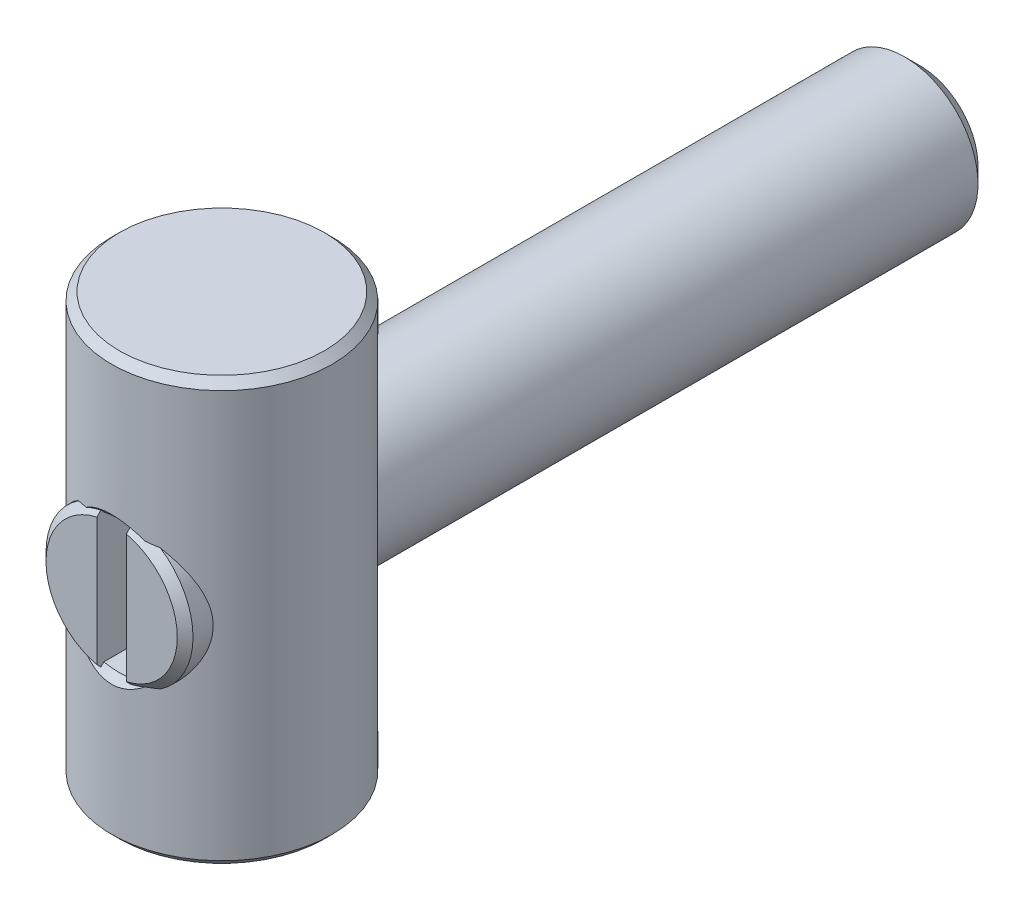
ISO-10303-21;
HEADER;
FILE_DESCRIPTION(('STEP AP214'),'2;1');
FILE_NAME('part.step','',(''),(''),'','','');
FILE_SCHEMA(('AUTOMOTIVE_DESIGN { 1 0 10303 214 1 1 1 1 }'));
ENDSEC;
DATA;
#1=APPLICATION_CONTEXT('core data for automotive mechanical design processes');
#2=APPLICATION_PROTOCOL_DEFINITION('international standard','automotive_design',2000,#1);
#3=PRODUCT_CONTEXT('',#1,'mechanical');
#4=PRODUCT('Part','Part','',(#3));
#5=PRODUCT_RELATED_PRODUCT_CATEGORY('part','',(#4));
#6=PRODUCT_DEFINITION_FORMATION('','',#4);
#7=PRODUCT_DEFINITION_CONTEXT('part definition',#1,'design');
#8=PRODUCT_DEFINITION('design','',#6,#7);
#9=PRODUCT_DEFINITION_SHAPE('','',#8);
#10=(LENGTH_UNIT() NAMED_UNIT(*) SI_UNIT(.MILLI.,.METRE.));
#11=(NAMED_UNIT(*) PLANE_ANGLE_UNIT() SI_UNIT($,.RADIAN.));
#12=(NAMED_UNIT(*) SI_UNIT($,.STERADIAN.) SOLID_ANGLE_UNIT());
#13=UNCERTAINTY_MEASURE_WITH_UNIT(LENGTH_MEASURE(1.E-05),#10,'distance_accuracy_value','');
#14=(GEOMETRIC_REPRESENTATION_CONTEXT(3) GLOBAL_UNCERTAINTY_ASSIGNED_CONTEXT((#13)) GLOBAL_UNIT_ASSIGNED_CONTEXT((#10,
#11,#12)) REPRESENTATION_CONTEXT('',''));
#15=CARTESIAN_POINT('',(0.,0.,0.));
#16=DIRECTION('',(0.,0.,1.));
#17=DIRECTION('',(1.,0.,0.));
#18=AXIS2_PLACEMENT_3D('',#15,#16,#17);
#19=CARTESIAN_POINT('',(0.,0.,-4.));
#20=DIRECTION('',(0.,0.,-1.));
#21=DIRECTION('',(-1.,0.,0.));
#22=AXIS2_PLACEMENT_3D('',#19,#20,#21);
#23=CYLINDRICAL_SURFACE('',#22,2.);
#24=CARTESIAN_POINT('',(1.11399719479,1.6610268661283,2.7855));
#25=CARTESIAN_POINT('',(1.16352046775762,1.62780404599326,2.76569630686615));
#26=CARTESIAN_POINT('',(1.21129322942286,1.59256213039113,2.74505589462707));
#27=CARTESIAN_POINT('',(1.30320814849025,1.51827100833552,2.70263011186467));
#28=CARTESIAN_POINT('',(1.34735150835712,1.47922307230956,2.68084512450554));
#29=CARTESIAN_POINT('',(1.47484746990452,1.35604681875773,2.61420147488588));
#30=CARTESIAN_POINT('',(1.55249324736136,1.26640812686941,2.56837763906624));
#31=CARTESIAN_POINT('',(1.69127884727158,1.07409237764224,2.47919034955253));
#32=CARTESIAN_POINT('',(1.75241552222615,0.971412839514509,2.43582736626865));
#33=CARTESIAN_POINT('',(1.85615019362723,0.754349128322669,2.35773638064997));
#34=CARTESIAN_POINT('',(1.89882852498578,0.640018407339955,2.32297124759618));
#35=CARTESIAN_POINT('',(1.95314493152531,0.438747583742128,2.27729599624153));
#36=CARTESIAN_POINT('',(1.97029467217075,0.354216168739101,2.26233654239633));
#37=CARTESIAN_POINT('',(1.99352675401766,0.182551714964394,2.24189698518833));
#38=CARTESIAN_POINT('',(1.99962325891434,0.0954221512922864,2.23640475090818));
#39=CARTESIAN_POINT('',(2.00034328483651,-0.079061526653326,2.23576112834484));
#40=CARTESIAN_POINT('',(1.99494860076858,-0.166415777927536,2.24062614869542));
#41=CARTESIAN_POINT('',(1.97303463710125,-0.338667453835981,2.25994148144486));
#42=CARTESIAN_POINT('',(1.95650152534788,-0.423561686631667,2.27440371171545));
#43=CARTESIAN_POINT('',(1.90813577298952,-0.608419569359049,2.31521704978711));
#44=CARTESIAN_POINT('',(1.87361856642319,-0.707228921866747,2.34356486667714));
#45=CARTESIAN_POINT('',(1.79082971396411,-0.8964602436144,2.40741595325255));
#46=CARTESIAN_POINT('',(1.7425316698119,-0.986865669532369,2.44293291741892));
#47=CARTESIAN_POINT('',(1.63252243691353,-1.15999565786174,2.51781416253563));
#48=CARTESIAN_POINT('',(1.57057489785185,-1.2425426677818,2.55723849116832));
#49=CARTESIAN_POINT('',(1.43480463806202,-1.39709631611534,2.63580434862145));
#50=CARTESIAN_POINT('',(1.36100810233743,-1.46912554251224,2.67494630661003));
#51=CARTESIAN_POINT('',(1.25497641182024,-1.55764120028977,2.72505273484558));
#52=CARTESIAN_POINT('',(1.22762940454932,-1.57928737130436,2.73749131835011));
#53=CARTESIAN_POINT('',(1.17172197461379,-1.62119899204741,2.76188255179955));
#54=CARTESIAN_POINT('',(1.14316238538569,-1.64146536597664,2.77383552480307));
#55=CARTESIAN_POINT('',(1.11399719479,-1.6610268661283,2.7855));
#56=B_SPLINE_CURVE_WITH_KNOTS('',3,(#24,#25,#26,#27,#28,#29,#30,#31,#32,#33,#34,#35,#36,#37,#38,
#39,#40,#41,#42,#43,#44,#45,#46,#47,#48,#49,#50,#51,#52,#53,#54,#55),.UNSPECIFIED.,.F.,.F.,(4,2,
2,2,2,2,2,2,2,2,2,2,2,2,2,4),(0.,0.188362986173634,0.376663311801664,0.756187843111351,
1.135784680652,1.51371238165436,1.77524600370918,2.03644425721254,2.29805662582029,
2.55999447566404,2.88356492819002,3.20775941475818,3.5380838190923,3.86768804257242,
3.97873730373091,4.08971143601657),.UNSPECIFIED.);
#57=CARTESIAN_POINT('',(1.11399719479,1.6610268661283,2.7855));
#58=VERTEX_POINT('',#57);
#59=CARTESIAN_POINT('',(1.11399719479,-1.6610268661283,2.7855));
#60=VERTEX_POINT('',#59);
#61=EDGE_CURVE('E228',#58,#60,#56,.T.);
#62=ORIENTED_EDGE('',*,*,#61,.F.);
#63=CARTESIAN_POINT('',(0.,0.,2.7855));
#64=DIRECTION('',(0.,0.,-1.));
#65=DIRECTION('',(-1.,0.,0.));
#66=AXIS2_PLACEMENT_3D('',#63,#64,#65);
#67=CIRCLE('',#66,2.);
#68=EDGE_CURVE('E125',#58,#60,#67,.T.);
#69=ORIENTED_EDGE('',*,*,#68,.T.);
#70=EDGE_LOOP('',(#62,#69));
#71=FACE_BOUND('',#70,.T.);
#72=ADVANCED_FACE('F14',(#71),#23,.T.);
#73=CARTESIAN_POINT('',(0.,0.,3.));
#74=DIRECTION('',(0.,0.,-1.));
#75=DIRECTION('',(-1.,0.,0.));
#76=AXIS2_PLACEMENT_3D('',#73,#74,#75);
#77=PLANE('',#76);
#78=DIRECTION('',(0.,-1.,0.));
#79=VECTOR('',#78,1.);
#80=CARTESIAN_POINT('',(-0.4,0.,3.));
#81=LINE('',#80,#79);
#82=CARTESIAN_POINT('',(-0.4,1.74011788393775,3.));
#83=VERTEX_POINT('',#82);
#84=CARTESIAN_POINT('',(-0.4,-1.74011788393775,3.));
#85=VERTEX_POINT('',#84);
#86=EDGE_CURVE('E110',#83,#85,#81,.T.);
#87=ORIENTED_EDGE('',*,*,#86,.F.);
#88=CARTESIAN_POINT('',(0.,0.,3.));
#89=DIRECTION('',(0.,0.,-1.));
#90=DIRECTION('',(-1.,0.,0.));
#91=AXIS2_PLACEMENT_3D('',#88,#89,#90);
#92=CIRCLE('',#91,1.7855);
#93=EDGE_CURVE('E121',#85,#83,#92,.T.);
#94=ORIENTED_EDGE('',*,*,#93,.F.);
#95=EDGE_LOOP('',(#87,#94));
#96=FACE_BOUND('',#95,.T.);
#97=ADVANCED_FACE('F120',(#96),#77,.F.);
#98=CARTESIAN_POINT('',(0.,0.,3.));
#99=DIRECTION('',(0.,0.,-1.));
#100=DIRECTION('',(-1.,0.,0.));
#101=AXIS2_PLACEMENT_3D('',#98,#99,#100);
#102=CONICAL_SURFACE('',#101,1.7855,0.785398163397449);
#103=CARTESIAN_POINT('',(-1.16667612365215,1.65104074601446,2.76385));
#104=CARTESIAN_POINT('',(-1.09329916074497,1.66504476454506,2.79481750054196));
#105=CARTESIAN_POINT('',(-1.01868995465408,1.67914160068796,2.82287437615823));
#106=CARTESIAN_POINT('',(-0.86782079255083,1.70596914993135,2.87283254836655));
#107=CARTESIAN_POINT('',(-0.791576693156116,1.7187090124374,2.89477692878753));
#108=CARTESIAN_POINT('',(-0.637125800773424,1.74152361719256,2.93264181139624));
#109=CARTESIAN_POINT('',(-0.558917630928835,1.75159642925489,2.94855795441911));
#110=CARTESIAN_POINT('',(-0.440293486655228,1.76402293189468,2.96778774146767));
#111=CARTESIAN_POINT('',(-0.400383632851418,1.76772662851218,2.97343575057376));
#112=CARTESIAN_POINT('',(-0.320283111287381,1.77413676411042,2.98312696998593));
#113=CARTESIAN_POINT('',(-0.280092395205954,1.77684302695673,2.98716989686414));
#114=CARTESIAN_POINT('',(-0.2398,1.77901031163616,2.99040063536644));
#115=B_SPLINE_CURVE_WITH_KNOTS('',3,(#103,#104,#105,#106,#107,#108,#109,#110,#111,#112,#113,
#114),.UNSPECIFIED.,.F.,.F.,(4,2,2,2,2,4),(0.,0.242566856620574,0.483378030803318,
0.724363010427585,0.845755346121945,0.967169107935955),.UNSPECIFIED.);
#116=CARTESIAN_POINT('',(-1.11399719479,1.6610268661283,2.7855));
#117=VERTEX_POINT('',#116);
#118=CARTESIAN_POINT('',(-0.794982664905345,1.71770344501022,2.89275));
#119=VERTEX_POINT('',#118);
#120=EDGE_CURVE('E9',#117,#119,#115,.T.);
#121=ORIENTED_EDGE('',*,*,#120,.F.);
#122=CARTESIAN_POINT('',(-1.11399719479,-1.6610268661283,2.7855));
#123=VERTEX_POINT('',#122);
#124=EDGE_CURVE('E130',#123,#117,#67,.T.);
#125=ORIENTED_EDGE('',*,*,#124,.F.);
#126=CARTESIAN_POINT('',(-0.2398,-1.77901031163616,2.99040063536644));
#127=CARTESIAN_POINT('',(-0.280092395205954,-1.77684302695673,2.98716989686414));
#128=CARTESIAN_POINT('',(-0.320283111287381,-1.77413676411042,2.98312696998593));
#129=CARTESIAN_POINT('',(-0.400383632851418,-1.76772662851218,2.97343575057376));
#130=CARTESIAN_POINT('',(-0.440293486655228,-1.76402293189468,2.96778774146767));
#131=CARTESIAN_POINT('',(-0.558917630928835,-1.75159642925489,2.94855795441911));
#132=CARTESIAN_POINT('',(-0.637125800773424,-1.74152361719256,2.93264181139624));
#133=CARTESIAN_POINT('',(-0.791576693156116,-1.7187090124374,2.89477692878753));
#134=CARTESIAN_POINT('',(-0.86782079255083,-1.70596914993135,2.87283254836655));
#135=CARTESIAN_POINT('',(-1.01868995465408,-1.67914160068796,2.82287437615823));
#136=CARTESIAN_POINT('',(-1.09329916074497,-1.66504476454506,2.79481750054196));
#137=CARTESIAN_POINT('',(-1.16667612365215,-1.65104074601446,2.76385));
#138=B_SPLINE_CURVE_WITH_KNOTS('',3,(#126,#127,#128,#129,#130,#131,#132,#133,#134,#135,#136,
#137),.UNSPECIFIED.,.F.,.F.,(4,2,2,2,2,4),(0.,0.12141376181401,0.24280609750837,
0.483791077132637,0.724602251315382,0.967169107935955),.UNSPECIFIED.);
#139=CARTESIAN_POINT('',(-0.794982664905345,-1.71770344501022,2.89275));
#140=VERTEX_POINT('',#139);
#141=EDGE_CURVE('E40',#140,#123,#138,.T.);
#142=ORIENTED_EDGE('',*,*,#141,.F.);
#143=CARTESIAN_POINT('',(0.,0.,2.89275));
#144=DIRECTION('',(0.,0.,1.));
#145=DIRECTION('',(1.,0.,0.));
#146=AXIS2_PLACEMENT_3D('',#143,#144,#145);
#147=CIRCLE('',#146,1.89275);
#148=CARTESIAN_POINT('',(-0.4,-1.85000069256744,2.89275));
#149=VERTEX_POINT('',#148);
#150=EDGE_CURVE('E196',#140,#149,#147,.T.);
#151=ORIENTED_EDGE('',*,*,#150,.T.);
#152=CARTESIAN_POINT('',(-0.4,1.96030622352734,2.7848));
#153=CARTESIAN_POINT('',(-0.4,1.91220040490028,2.83193265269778));
#154=CARTESIAN_POINT('',(-0.4,1.86406179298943,2.87903187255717));
#155=CARTESIAN_POINT('',(-0.4,1.76762008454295,2.97321655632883));
#156=CARTESIAN_POINT('',(-0.4,1.71931684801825,3.02030187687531));
#157=CARTESIAN_POINT('',(-0.4,1.6212885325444,3.11563710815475));
#158=CARTESIAN_POINT('',(-0.4,1.5715604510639,3.16388393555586));
#159=CARTESIAN_POINT('',(-0.4,1.47203148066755,3.26014103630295));
#160=CARTESIAN_POINT('',(-0.4,1.42223083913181,3.30815156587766));
#161=CARTESIAN_POINT('',(-0.4,1.27910635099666,3.44557059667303));
#162=CARTESIAN_POINT('',(-0.4,1.18553880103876,3.53472711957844));
#163=CARTESIAN_POINT('',(-0.4,1.04389226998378,3.66771074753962));
#164=CARTESIAN_POINT('',(-0.4,0.996302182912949,3.71205806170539));
#165=CARTESIAN_POINT('',(-0.4,0.900663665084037,3.80018516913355));
#166=CARTESIAN_POINT('',(-0.4,0.852615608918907,3.84396536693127));
#167=CARTESIAN_POINT('',(-0.4,0.757010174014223,3.9295656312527));
#168=CARTESIAN_POINT('',(-0.4,0.709472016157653,3.97140714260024));
#169=CARTESIAN_POINT('',(-0.4,0.613103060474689,4.05388760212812));
#170=CARTESIAN_POINT('',(-0.4,0.564268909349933,4.0945227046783));
#171=CARTESIAN_POINT('',(-0.4,0.489794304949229,4.15330063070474));
#172=CARTESIAN_POINT('',(-0.4,0.464926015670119,4.17241703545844));
#173=CARTESIAN_POINT('',(-0.4,0.414504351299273,4.2097188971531));
#174=CARTESIAN_POINT('',(-0.4,0.388951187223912,4.22790463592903));
#175=CARTESIAN_POINT('',(-0.4,0.337021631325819,4.26280071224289));
#176=CARTESIAN_POINT('',(-0.4,0.310649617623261,4.27951751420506));
#177=CARTESIAN_POINT('',(-0.4,0.25664656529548,4.31075573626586));
#178=CARTESIAN_POINT('',(-0.4,0.229017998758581,4.32528124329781));
#179=CARTESIAN_POINT('',(-0.4,0.194529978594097,4.34073824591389));
#180=CARTESIAN_POINT('',(-0.4,0.188431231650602,4.34337414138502));
#181=CARTESIAN_POINT('',(-0.4,0.176155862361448,4.34846503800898));
#182=CARTESIAN_POINT('',(-0.4,0.169979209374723,4.35091996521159));
#183=CARTESIAN_POINT('',(-0.4,0.151336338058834,4.35798334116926));
#184=CARTESIAN_POINT('',(-0.4,0.138753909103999,4.36229188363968));
#185=CARTESIAN_POINT('',(-0.4,0.113503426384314,4.36987933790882));
#186=CARTESIAN_POINT('',(-0.4,0.100840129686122,4.37317392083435));
#187=CARTESIAN_POINT('',(-0.4,0.0752707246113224,4.37867100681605));
#188=CARTESIAN_POINT('',(-0.4,0.0623645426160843,4.38087317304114));
#189=CARTESIAN_POINT('',(-0.4,0.0361451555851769,4.38408457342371));
#190=CARTESIAN_POINT('',(-0.4,0.0228289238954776,4.38506967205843));
#191=CARTESIAN_POINT('',(-0.4,-0.00382941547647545,4.38570474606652));
#192=CARTESIAN_POINT('',(-0.4,-0.0171715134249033,4.38535515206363));
#193=CARTESIAN_POINT('',(-0.4,-0.0570913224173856,4.38231129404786));
#194=CARTESIAN_POINT('',(-0.4,-0.0835282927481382,4.37761777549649));
#195=CARTESIAN_POINT('',(-0.4,-0.144402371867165,4.36159805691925));
#196=CARTESIAN_POINT('',(-0.4,-0.178344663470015,4.34850779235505));
#197=CARTESIAN_POINT('',(-0.4,-0.227667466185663,4.32547752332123));
#198=CARTESIAN_POINT('',(-0.4,-0.243900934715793,4.31719757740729));
#199=CARTESIAN_POINT('',(-0.4,-0.275892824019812,4.29976597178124));
#200=CARTESIAN_POINT('',(-0.4,-0.291651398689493,4.29061459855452));
#201=CARTESIAN_POINT('',(-0.4,-0.342427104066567,4.25969743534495));
#202=CARTESIAN_POINT('',(-0.4,-0.376624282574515,4.23660064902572));
#203=CARTESIAN_POINT('',(-0.4,-0.443707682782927,4.18856142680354));
#204=CARTESIAN_POINT('',(-0.4,-0.476592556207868,4.16361716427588));
#205=CARTESIAN_POINT('',(-0.4,-0.541555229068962,4.11253731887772));
#206=CARTESIAN_POINT('',(-0.4,-0.573630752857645,4.08639885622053));
#207=CARTESIAN_POINT('',(-0.4,-0.637167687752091,4.03338342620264));
#208=CARTESIAN_POINT('',(-0.4,-0.668629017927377,4.00650636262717));
#209=CARTESIAN_POINT('',(-0.4,-0.762581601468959,3.92494921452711));
#210=CARTESIAN_POINT('',(-0.4,-0.824422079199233,3.86952173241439));
#211=CARTESIAN_POINT('',(-0.4,-0.947059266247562,3.75773288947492));
#212=CARTESIAN_POINT('',(-0.4,-1.00785750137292,3.70137318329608));
#213=CARTESIAN_POINT('',(-0.4,-1.14419995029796,3.57369126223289));
#214=CARTESIAN_POINT('',(-0.4,-1.21957997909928,3.50219383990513));
#215=CARTESIAN_POINT('',(-0.4,-1.36985690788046,3.35860627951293));
#216=CARTESIAN_POINT('',(-0.4,-1.44475349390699,3.28651581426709));
#217=CARTESIAN_POINT('',(-0.4,-1.59323885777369,3.1429244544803));
#218=CARTESIAN_POINT('',(-0.4,-1.66683198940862,3.07142805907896));
#219=CARTESIAN_POINT('',(-0.4,-1.81374089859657,2.92824339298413));
#220=CARTESIAN_POINT('',(-0.4,-1.88705682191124,2.85655527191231));
#221=CARTESIAN_POINT('',(-0.4,-1.96030622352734,2.7848));
#222=B_SPLINE_CURVE_WITH_KNOTS('',3,(#152,#153,#154,#155,#156,#157,#158,#159,#160,#161,#162,
#163,#164,#165,#166,#167,#168,#169,#170,#171,#172,#173,#174,#175,#176,#177,#178,#179,#180,#181,
#182,#183,#184,#185,#186,#187,#188,#189,#190,#191,#192,#193,#194,#195,#196,#197,#198,#199,#200,
#201,#202,#203,#204,#205,#206,#207,#208,#209,#210,#211,#212,#213,#214,#215,#216,#217,#218,#219,
#220,#221),.UNSPECIFIED.,.F.,.F.,(4,2,2,2,2,2,2,2,2,2,2,2,2,2,2,2,2,2,2,2,2,2,2,2,2,2,2,2,2,2,2,
2,2,2,4),(0.,0.202041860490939,0.404407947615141,0.612267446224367,0.819791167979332,
1.20751042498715,1.40265824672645,1.59765821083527,1.78763722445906,1.97816800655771,
2.07225481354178,2.16631295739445,2.25993394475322,2.35337810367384,2.37330754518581,
2.39324508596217,2.43310931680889,2.47232228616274,2.51154733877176,2.5515383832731,
2.59151652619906,2.67157438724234,2.78007616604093,2.83473709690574,2.88938011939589,
3.0130530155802,3.13684986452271,3.26096287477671,3.38509213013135,3.63419872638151,
3.88290259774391,4.19457948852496,4.50644172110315,4.8142545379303,5.12187303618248),.UNSPECIFIED.);
#223=EDGE_CURVE('E117',#85,#149,#222,.T.);
#224=ORIENTED_EDGE('',*,*,#223,.F.);
#225=ORIENTED_EDGE('',*,*,#93,.T.);
#226=CARTESIAN_POINT('',(-0.4,1.85000069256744,2.89275));
#227=VERTEX_POINT('',#226);
#228=EDGE_CURVE('E106',#227,#83,#222,.T.);
#229=ORIENTED_EDGE('',*,*,#228,.F.);
#230=CARTESIAN_POINT('',(0.,0.,2.89275));
#231=DIRECTION('',(0.,0.,1.));
#232=DIRECTION('',(1.,0.,0.));
#233=AXIS2_PLACEMENT_3D('',#230,#231,#232);
#234=CIRCLE('',#233,1.89275);
#235=EDGE_CURVE('E28',#227,#119,#234,.T.);
#236=ORIENTED_EDGE('',*,*,#235,.T.);
#237=EDGE_LOOP('',(#121,#125,#142,#151,#224,#225,#229,#236));
#238=FACE_BOUND('',#237,.T.);
#239=ADVANCED_FACE('F123',(#238),#102,.T.);
#240=CARTESIAN_POINT('',(0.4,0.,33.));
#241=DIRECTION('',(-1.,0.,0.));
#242=DIRECTION('',(0.,-1.,0.));
#243=AXIS2_PLACEMENT_3D('',#240,#241,#242);
#244=CYLINDRICAL_SURFACE('',#243,31.5);
#245=CARTESIAN_POINT('',(0.4,-1.76576053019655,1.54952957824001));
#246=CARTESIAN_POINT('',(0.349977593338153,-1.77709824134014,1.55016706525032));
#247=CARTESIAN_POINT('',(0.299469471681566,-1.78629930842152,1.55068890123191));
#248=CARTESIAN_POINT('',(0.197847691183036,-1.80038671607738,1.55149171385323));
#249=CARTESIAN_POINT('',(0.146733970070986,-1.8052726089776,1.55177266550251));
#250=CARTESIAN_POINT('',(0.0452193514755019,-1.81063609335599,1.55208115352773));
#251=CARTESIAN_POINT('',(-0.00517737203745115,-1.81119308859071,1.55211325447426));
#252=CARTESIAN_POINT('',(-0.105833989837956,-1.80810483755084,1.55193550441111));
#253=CARTESIAN_POINT('',(-0.156093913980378,-1.8044605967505,1.55172571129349));
#254=CARTESIAN_POINT('',(-0.238696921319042,-1.79499603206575,1.5511843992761));
#255=CARTESIAN_POINT('',(-0.271182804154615,-1.7903758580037,1.55092073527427));
#256=CARTESIAN_POINT('',(-0.335843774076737,-1.77938039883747,1.55029676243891));
#257=CARTESIAN_POINT('',(-0.368018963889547,-1.77300571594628,1.5499364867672));
#258=CARTESIAN_POINT('',(-0.4,-1.76576053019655,1.54952957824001));
#259=B_SPLINE_CURVE_WITH_KNOTS('',3,(#245,#246,#247,#248,#249,#250,#251,#252,#253,#254,#255,
#256,#257,#258),.UNSPECIFIED.,.F.,.F.,(4,2,2,2,2,2,4),(0.,0.153839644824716,0.307695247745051,
0.458721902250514,0.609712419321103,0.708108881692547,0.806471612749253),.UNSPECIFIED.);
#260=CARTESIAN_POINT('',(0.4,-1.76576053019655,1.54952957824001));
#261=VERTEX_POINT('',#260);
#262=CARTESIAN_POINT('',(-0.4,-1.76576053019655,1.54952957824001));
#263=VERTEX_POINT('',#262);
#264=EDGE_CURVE('E301',#261,#263,#259,.T.);
#265=ORIENTED_EDGE('',*,*,#264,.F.);
#266=CARTESIAN_POINT('',(0.4,0.,33.));
#267=DIRECTION('',(1.,0.,0.));
#268=DIRECTION('',(0.,1.,0.));
#269=AXIS2_PLACEMENT_3D('',#266,#267,#268);
#270=CIRCLE('',#269,31.5);
#271=CARTESIAN_POINT('',(0.4,1.76576053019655,1.54952957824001));
#272=VERTEX_POINT('',#271);
#273=EDGE_CURVE('E115',#261,#272,#270,.T.);
#274=ORIENTED_EDGE('',*,*,#273,.T.);
#275=CARTESIAN_POINT('',(-0.4,1.76576053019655,1.54952957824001));
#276=CARTESIAN_POINT('',(-0.349977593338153,1.77709824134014,1.55016706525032));
#277=CARTESIAN_POINT('',(-0.299469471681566,1.78629930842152,1.55068890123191));
#278=CARTESIAN_POINT('',(-0.197847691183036,1.80038671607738,1.55149171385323));
#279=CARTESIAN_POINT('',(-0.146733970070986,1.8052726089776,1.55177266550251));
#280=CARTESIAN_POINT('',(-0.0452193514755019,1.81063609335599,1.55208115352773));
#281=CARTESIAN_POINT('',(0.00517737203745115,1.81119308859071,1.55211325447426));
#282=CARTESIAN_POINT('',(0.105833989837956,1.80810483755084,1.55193550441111));
#283=CARTESIAN_POINT('',(0.156093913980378,1.8044605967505,1.55172571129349));
#284=CARTESIAN_POINT('',(0.238696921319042,1.79499603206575,1.5511843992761));
#285=CARTESIAN_POINT('',(0.271182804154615,1.7903758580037,1.55092073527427));
#286=CARTESIAN_POINT('',(0.335843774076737,1.77938039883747,1.55029676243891));
#287=CARTESIAN_POINT('',(0.368018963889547,1.77300571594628,1.5499364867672));
#288=CARTESIAN_POINT('',(0.4,1.76576053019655,1.54952957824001));
#289=B_SPLINE_CURVE_WITH_KNOTS('',3,(#275,#276,#277,#278,#279,#280,#281,#282,#283,#284,#285,
#286,#287,#288),.UNSPECIFIED.,.F.,.F.,(4,2,2,2,2,2,4),(0.,0.153839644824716,0.307695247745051,
0.458721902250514,0.609712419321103,0.708108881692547,0.806471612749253),.UNSPECIFIED.);
#290=CARTESIAN_POINT('',(-0.4,1.76576053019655,1.54952957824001));
#291=VERTEX_POINT('',#290);
#292=EDGE_CURVE('E194',#291,#272,#289,.T.);
#293=ORIENTED_EDGE('',*,*,#292,.F.);
#294=CARTESIAN_POINT('',(-0.4,0.,33.));
#295=DIRECTION('',(1.,0.,0.));
#296=DIRECTION('',(0.,1.,0.));
#297=AXIS2_PLACEMENT_3D('',#294,#295,#296);
#298=CIRCLE('',#297,31.5);
#299=EDGE_CURVE('E290',#263,#291,#298,.T.);
#300=ORIENTED_EDGE('',*,*,#299,.F.);
#301=EDGE_LOOP('',(#265,#274,#293,#300));
#302=FACE_BOUND('',#301,.T.);
#303=ADVANCED_FACE('F278',(#302),#244,.F.);
#304=CARTESIAN_POINT('',(-0.4,0.,33.));
#305=DIRECTION('',(1.,0.,0.));
#306=DIRECTION('',(0.,1.,0.));
#307=AXIS2_PLACEMENT_3D('',#304,#305,#306);
#308=PLANE('',#307);
#309=CARTESIAN_POINT('',(-0.4,-1.02034635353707,2.09595012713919));
#310=CARTESIAN_POINT('',(-0.4,-1.05950736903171,2.13241722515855));
#311=CARTESIAN_POINT('',(-0.4,-1.09853653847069,2.16902508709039));
#312=CARTESIAN_POINT('',(-0.4,-1.17638543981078,2.24246200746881));
#313=CARTESIAN_POINT('',(-0.4,-1.21520517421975,2.2792910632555));
#314=CARTESIAN_POINT('',(-0.4,-1.33143077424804,2.39001871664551));
#315=CARTESIAN_POINT('',(-0.4,-1.40860528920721,2.46415991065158));
#316=CARTESIAN_POINT('',(-0.4,-1.56257008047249,2.6128326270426));
#317=CARTESIAN_POINT('',(-0.4,-1.6393603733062,2.6873641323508));
#318=CARTESIAN_POINT('',(-0.4,-1.79268710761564,2.83668891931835));
#319=CARTESIAN_POINT('',(-0.4,-1.86922354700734,2.91148220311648));
#320=CARTESIAN_POINT('',(-0.4,-2.0533689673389,3.0918524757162));
#321=CARTESIAN_POINT('',(-0.4,-2.16089223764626,3.19751690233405));
#322=CARTESIAN_POINT('',(-0.4,-2.37571065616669,3.40908334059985));
#323=CARTESIAN_POINT('',(-0.4,-2.48300579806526,3.51498535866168));
#324=CARTESIAN_POINT('',(-0.4,-2.59024265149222,3.62094582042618));
#325=B_SPLINE_CURVE_WITH_KNOTS('',3,(#309,#310,#311,#312,#313,#314,#315,#316,#317,#318,#319,
#320,#321,#322,#323,#324),.UNSPECIFIED.,.F.,.F.,(4,2,2,2,2,2,2,4),(0.,0.160532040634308,
0.321062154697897,0.64211312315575,0.963150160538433,1.2841898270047,1.73644596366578,
2.18871445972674),.UNSPECIFIED.);
#326=CARTESIAN_POINT('',(-0.4,-1.76576053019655,2.8105));
#327=VERTEX_POINT('',#326);
#328=EDGE_CURVE('E180',#327,#149,#325,.T.);
#329=ORIENTED_EDGE('',*,*,#328,.F.);
#330=DIRECTION('',(0.,0.,-1.));
#331=VECTOR('',#330,1.);
#332=CARTESIAN_POINT('',(-0.4,-1.76576053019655,-3.));
#333=LINE('',#332,#331);
#334=EDGE_CURVE('E142',#263,#327,#333,.F.);
#335=ORIENTED_EDGE('',*,*,#334,.F.);
#336=ORIENTED_EDGE('',*,*,#299,.T.);
#337=DIRECTION('',(0.,0.,-1.));
#338=VECTOR('',#337,1.);
#339=CARTESIAN_POINT('',(-0.4,1.76576053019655,-3.));
#340=LINE('',#339,#338);
#341=CARTESIAN_POINT('',(-0.4,1.76576053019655,2.8105));
#342=VERTEX_POINT('',#341);
#343=EDGE_CURVE('E128',#342,#291,#340,.T.);
#344=ORIENTED_EDGE('',*,*,#343,.F.);
#345=CARTESIAN_POINT('',(-0.4,2.59024265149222,3.62094582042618));
#346=CARTESIAN_POINT('',(-0.4,2.46048935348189,3.49276389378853));
#347=CARTESIAN_POINT('',(-0.4,2.33066988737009,3.3646473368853));
#348=CARTESIAN_POINT('',(-0.4,2.0706621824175,3.10879920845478));
#349=CARTESIAN_POINT('',(-0.4,1.9404739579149,2.98106762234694));
#350=CARTESIAN_POINT('',(-0.4,1.74472718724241,2.78993924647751));
#351=CARTESIAN_POINT('',(-0.4,1.67939930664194,2.72630645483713));
#352=CARTESIAN_POINT('',(-0.4,1.5485207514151,2.59927137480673));
#353=CARTESIAN_POINT('',(-0.4,1.48297007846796,2.5358690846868));
#354=CARTESIAN_POINT('',(-0.4,1.35155357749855,2.40938546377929));
#355=CARTESIAN_POINT('',(-0.4,1.285687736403,2.34630414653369));
#356=CARTESIAN_POINT('',(-0.4,1.15344707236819,2.22067435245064));
#357=CARTESIAN_POINT('',(-0.4,1.08707223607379,2.15812588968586));
#358=CARTESIAN_POINT('',(-0.4,1.02034635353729,2.09595012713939));
#359=B_SPLINE_CURVE_WITH_KNOTS('',3,(#345,#346,#347,#348,#349,#350,#351,#352,#353,#354,#355,
#356,#357,#358),.UNSPECIFIED.,.F.,.F.,(4,2,2,2,2,2,4),(0.,0.54717523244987,1.09432947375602,
1.36791954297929,1.6415075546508,1.91510701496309,2.18871367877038),.UNSPECIFIED.);
#360=EDGE_CURVE('E113',#227,#342,#359,.T.);
#361=ORIENTED_EDGE('',*,*,#360,.F.);
#362=ORIENTED_EDGE('',*,*,#228,.T.);
#363=ORIENTED_EDGE('',*,*,#86,.T.);
#364=ORIENTED_EDGE('',*,*,#223,.T.);
#365=EDGE_LOOP('',(#329,#335,#336,#344,#361,#362,#363,#364));
#366=FACE_BOUND('',#365,.T.);
#367=ADVANCED_FACE('F108',(#366),#308,.T.);
#368=CARTESIAN_POINT('',(0.4,1.74011788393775,3.));
#369=VERTEX_POINT('',#368);
#370=CARTESIAN_POINT('',(0.4,-1.74011788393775,3.));
#371=VERTEX_POINT('',#370);
#372=EDGE_CURVE('E124',#369,#371,#92,.T.);
#373=ORIENTED_EDGE('',*,*,#372,.F.);
#374=DIRECTION('',(0.,-1.,0.));
#375=VECTOR('',#374,1.);
#376=CARTESIAN_POINT('',(0.4,0.,3.));
#377=LINE('',#376,#375);
#378=EDGE_CURVE('E365',#369,#371,#377,.T.);
#379=ORIENTED_EDGE('',*,*,#378,.T.);
#380=EDGE_LOOP('',(#373,#379));
#381=FACE_BOUND('',#380,.T.);
#382=ADVANCED_FACE('F279',(#381),#77,.F.);
#383=CARTESIAN_POINT('',(0.2398,1.77901031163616,2.99040063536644));
#384=CARTESIAN_POINT('',(0.280092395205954,1.77684302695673,2.98716989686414));
#385=CARTESIAN_POINT('',(0.320283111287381,1.77413676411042,2.98312696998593));
#386=CARTESIAN_POINT('',(0.400383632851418,1.76772662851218,2.97343575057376));
#387=CARTESIAN_POINT('',(0.440293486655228,1.76402293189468,2.96778774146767));
#388=CARTESIAN_POINT('',(0.558917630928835,1.75159642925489,2.94855795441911));
#389=CARTESIAN_POINT('',(0.637125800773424,1.74152361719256,2.93264181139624));
#390=CARTESIAN_POINT('',(0.791576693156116,1.7187090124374,2.89477692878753));
#391=CARTESIAN_POINT('',(0.86782079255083,1.70596914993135,2.87283254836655));
#392=CARTESIAN_POINT('',(1.01868995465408,1.67914160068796,2.82287437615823));
#393=CARTESIAN_POINT('',(1.09329916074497,1.66504476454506,2.79481750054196));
#394=CARTESIAN_POINT('',(1.16667612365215,1.65104074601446,2.76385));
#395=B_SPLINE_CURVE_WITH_KNOTS('',3,(#383,#384,#385,#386,#387,#388,#389,#390,#391,#392,#393,
#394),.UNSPECIFIED.,.F.,.F.,(4,2,2,2,2,4),(0.,0.12141376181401,0.24280609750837,
0.483791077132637,0.724602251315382,0.967169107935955),.UNSPECIFIED.);
#396=CARTESIAN_POINT('',(0.794982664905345,1.71770344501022,2.89275));
#397=VERTEX_POINT('',#396);
#398=EDGE_CURVE('E226',#397,#58,#395,.T.);
#399=ORIENTED_EDGE('',*,*,#398,.F.);
#400=CARTESIAN_POINT('',(0.,0.,2.89275));
#401=DIRECTION('',(0.,0.,1.));
#402=DIRECTION('',(1.,0.,0.));
#403=AXIS2_PLACEMENT_3D('',#400,#401,#402);
#404=CIRCLE('',#403,1.89275);
#405=CARTESIAN_POINT('',(0.4,1.85000069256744,2.89275));
#406=VERTEX_POINT('',#405);
#407=EDGE_CURVE('E223',#397,#406,#404,.T.);
#408=ORIENTED_EDGE('',*,*,#407,.T.);
#409=CARTESIAN_POINT('',(0.4,1.96030622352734,2.7848));
#410=CARTESIAN_POINT('',(0.4,1.91220040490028,2.83193265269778));
#411=CARTESIAN_POINT('',(0.4,1.86406179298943,2.87903187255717));
#412=CARTESIAN_POINT('',(0.4,1.76762008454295,2.97321655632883));
#413=CARTESIAN_POINT('',(0.4,1.71931684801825,3.02030187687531));
#414=CARTESIAN_POINT('',(0.4,1.6212885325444,3.11563710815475));
#415=CARTESIAN_POINT('',(0.4,1.5715604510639,3.16388393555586));
#416=CARTESIAN_POINT('',(0.4,1.47203148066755,3.26014103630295));
#417=CARTESIAN_POINT('',(0.4,1.42223083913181,3.30815156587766));
#418=CARTESIAN_POINT('',(0.4,1.27910635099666,3.44557059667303));
#419=CARTESIAN_POINT('',(0.4,1.18553880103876,3.53472711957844));
#420=CARTESIAN_POINT('',(0.4,1.04389226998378,3.66771074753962));
#421=CARTESIAN_POINT('',(0.4,0.996302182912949,3.71205806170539));
#422=CARTESIAN_POINT('',(0.4,0.900663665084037,3.80018516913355));
#423=CARTESIAN_POINT('',(0.4,0.852615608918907,3.84396536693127));
#424=CARTESIAN_POINT('',(0.4,0.757010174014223,3.9295656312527));
#425=CARTESIAN_POINT('',(0.4,0.709472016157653,3.97140714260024));
#426=CARTESIAN_POINT('',(0.4,0.613103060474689,4.05388760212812));
#427=CARTESIAN_POINT('',(0.4,0.564268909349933,4.0945227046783));
#428=CARTESIAN_POINT('',(0.4,0.489794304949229,4.15330063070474));
#429=CARTESIAN_POINT('',(0.4,0.464926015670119,4.17241703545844));
#430=CARTESIAN_POINT('',(0.4,0.414504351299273,4.2097188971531));
#431=CARTESIAN_POINT('',(0.4,0.388951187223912,4.22790463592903));
#432=CARTESIAN_POINT('',(0.4,0.337021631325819,4.26280071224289));
#433=CARTESIAN_POINT('',(0.4,0.310649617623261,4.27951751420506));
#434=CARTESIAN_POINT('',(0.4,0.25664656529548,4.31075573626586));
#435=CARTESIAN_POINT('',(0.4,0.229017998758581,4.32528124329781));
#436=CARTESIAN_POINT('',(0.4,0.194529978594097,4.34073824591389));
#437=CARTESIAN_POINT('',(0.4,0.188431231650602,4.34337414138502));
#438=CARTESIAN_POINT('',(0.4,0.176155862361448,4.34846503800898));
#439=CARTESIAN_POINT('',(0.4,0.169979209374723,4.35091996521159));
#440=CARTESIAN_POINT('',(0.4,0.151336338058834,4.35798334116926));
#441=CARTESIAN_POINT('',(0.4,0.138753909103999,4.36229188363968));
#442=CARTESIAN_POINT('',(0.4,0.113503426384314,4.36987933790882));
#443=CARTESIAN_POINT('',(0.4,0.100840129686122,4.37317392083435));
#444=CARTESIAN_POINT('',(0.4,0.0752707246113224,4.37867100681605));
#445=CARTESIAN_POINT('',(0.4,0.0623645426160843,4.38087317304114));
#446=CARTESIAN_POINT('',(0.4,0.0361451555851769,4.38408457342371));
#447=CARTESIAN_POINT('',(0.4,0.0228289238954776,4.38506967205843));
#448=CARTESIAN_POINT('',(0.4,-0.00382941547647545,4.38570474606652));
#449=CARTESIAN_POINT('',(0.4,-0.0171715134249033,4.38535515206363));
#450=CARTESIAN_POINT('',(0.4,-0.0570913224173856,4.38231129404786));
#451=CARTESIAN_POINT('',(0.4,-0.0835282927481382,4.37761777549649));
#452=CARTESIAN_POINT('',(0.4,-0.144402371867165,4.36159805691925));
#453=CARTESIAN_POINT('',(0.4,-0.178344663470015,4.34850779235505));
#454=CARTESIAN_POINT('',(0.4,-0.227667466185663,4.32547752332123));
#455=CARTESIAN_POINT('',(0.4,-0.243900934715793,4.31719757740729));
#456=CARTESIAN_POINT('',(0.4,-0.275892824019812,4.29976597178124));
#457=CARTESIAN_POINT('',(0.4,-0.291651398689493,4.29061459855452));
#458=CARTESIAN_POINT('',(0.4,-0.342427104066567,4.25969743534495));
#459=CARTESIAN_POINT('',(0.4,-0.376624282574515,4.23660064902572));
#460=CARTESIAN_POINT('',(0.4,-0.443707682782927,4.18856142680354));
#461=CARTESIAN_POINT('',(0.4,-0.476592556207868,4.16361716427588));
#462=CARTESIAN_POINT('',(0.4,-0.541555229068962,4.11253731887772));
#463=CARTESIAN_POINT('',(0.4,-0.573630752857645,4.08639885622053));
#464=CARTESIAN_POINT('',(0.4,-0.637167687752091,4.03338342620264));
#465=CARTESIAN_POINT('',(0.4,-0.668629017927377,4.00650636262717));
#466=CARTESIAN_POINT('',(0.4,-0.762581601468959,3.92494921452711));
#467=CARTESIAN_POINT('',(0.4,-0.824422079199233,3.86952173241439));
#468=CARTESIAN_POINT('',(0.4,-0.947059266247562,3.75773288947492));
#469=CARTESIAN_POINT('',(0.4,-1.00785750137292,3.70137318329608));
#470=CARTESIAN_POINT('',(0.4,-1.14419995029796,3.57369126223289));
#471=CARTESIAN_POINT('',(0.4,-1.21957997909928,3.50219383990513));
#472=CARTESIAN_POINT('',(0.4,-1.36985690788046,3.35860627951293));
#473=CARTESIAN_POINT('',(0.4,-1.44475349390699,3.28651581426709));
#474=CARTESIAN_POINT('',(0.4,-1.59323885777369,3.1429244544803));
#475=CARTESIAN_POINT('',(0.4,-1.66683198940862,3.07142805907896));
#476=CARTESIAN_POINT('',(0.4,-1.81374089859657,2.92824339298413));
#477=CARTESIAN_POINT('',(0.4,-1.88705682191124,2.85655527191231));
#478=CARTESIAN_POINT('',(0.4,-1.96030622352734,2.7848));
#479=B_SPLINE_CURVE_WITH_KNOTS('',3,(#409,#410,#411,#412,#413,#414,#415,#416,#417,#418,#419,
#420,#421,#422,#423,#424,#425,#426,#427,#428,#429,#430,#431,#432,#433,#434,#435,#436,#437,#438,
#439,#440,#441,#442,#443,#444,#445,#446,#447,#448,#449,#450,#451,#452,#453,#454,#455,#456,#457,
#458,#459,#460,#461,#462,#463,#464,#465,#466,#467,#468,#469,#470,#471,#472,#473,#474,#475,#476,
#477,#478),.UNSPECIFIED.,.F.,.F.,(4,2,2,2,2,2,2,2,2,2,2,2,2,2,2,2,2,2,2,2,2,2,2,2,2,2,2,2,2,2,2,
2,2,2,4),(0.,0.202041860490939,0.404407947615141,0.612267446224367,0.819791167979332,
1.20751042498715,1.40265824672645,1.59765821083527,1.78763722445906,1.97816800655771,
2.07225481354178,2.16631295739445,2.25993394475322,2.35337810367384,2.37330754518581,
2.39324508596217,2.43310931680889,2.47232228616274,2.51154733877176,2.5515383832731,
2.59151652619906,2.67157438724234,2.78007616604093,2.83473709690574,2.88938011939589,
3.0130530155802,3.13684986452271,3.26096287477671,3.38509213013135,3.63419872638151,
3.88290259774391,4.19457948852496,4.50644172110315,4.8142545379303,5.12187303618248),.UNSPECIFIED.);
#480=EDGE_CURVE('E209',#406,#369,#479,.T.);
#481=ORIENTED_EDGE('',*,*,#480,.T.);
#482=ORIENTED_EDGE('',*,*,#372,.T.);
#483=CARTESIAN_POINT('',(0.4,-1.85000069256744,2.89275));
#484=VERTEX_POINT('',#483);
#485=EDGE_CURVE('E366',#371,#484,#479,.T.);
#486=ORIENTED_EDGE('',*,*,#485,.T.);
#487=CARTESIAN_POINT('',(0.,0.,2.89275));
#488=DIRECTION('',(0.,0.,1.));
#489=DIRECTION('',(1.,0.,0.));
#490=AXIS2_PLACEMENT_3D('',#487,#488,#489);
#491=CIRCLE('',#490,1.89275);
#492=CARTESIAN_POINT('',(0.794982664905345,-1.71770344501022,2.89275));
#493=VERTEX_POINT('',#492);
#494=EDGE_CURVE('E198',#484,#493,#491,.T.);
#495=ORIENTED_EDGE('',*,*,#494,.T.);
#496=CARTESIAN_POINT('',(1.16667612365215,-1.65104074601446,2.76385));
#497=CARTESIAN_POINT('',(1.09329916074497,-1.66504476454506,2.79481750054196));
#498=CARTESIAN_POINT('',(1.01868995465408,-1.67914160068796,2.82287437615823));
#499=CARTESIAN_POINT('',(0.86782079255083,-1.70596914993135,2.87283254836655));
#500=CARTESIAN_POINT('',(0.791576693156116,-1.7187090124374,2.89477692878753));
#501=CARTESIAN_POINT('',(0.637125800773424,-1.74152361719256,2.93264181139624));
#502=CARTESIAN_POINT('',(0.558917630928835,-1.75159642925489,2.94855795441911));
#503=CARTESIAN_POINT('',(0.440293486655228,-1.76402293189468,2.96778774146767));
#504=CARTESIAN_POINT('',(0.400383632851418,-1.76772662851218,2.97343575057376));
#505=CARTESIAN_POINT('',(0.320283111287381,-1.77413676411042,2.98312696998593));
#506=CARTESIAN_POINT('',(0.280092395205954,-1.77684302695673,2.98716989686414));
#507=CARTESIAN_POINT('',(0.2398,-1.77901031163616,2.99040063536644));
#508=B_SPLINE_CURVE_WITH_KNOTS('',3,(#496,#497,#498,#499,#500,#501,#502,#503,#504,#505,#506,
#507),.UNSPECIFIED.,.F.,.F.,(4,2,2,2,2,4),(0.,0.242566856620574,0.483378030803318,
0.724363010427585,0.845755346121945,0.967169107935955),.UNSPECIFIED.);
#509=EDGE_CURVE('E227',#60,#493,#508,.T.);
#510=ORIENTED_EDGE('',*,*,#509,.F.);
#511=ORIENTED_EDGE('',*,*,#68,.F.);
#512=EDGE_LOOP('',(#399,#408,#481,#482,#486,#495,#510,#511));
#513=FACE_BOUND('',#512,.T.);
#514=ADVANCED_FACE('F204',(#513),#102,.T.);
#515=CARTESIAN_POINT('',(0.4,0.,33.));
#516=DIRECTION('',(1.,0.,0.));
#517=DIRECTION('',(0.,1.,0.));
#518=AXIS2_PLACEMENT_3D('',#515,#516,#517);
#519=PLANE('',#518);
#520=DIRECTION('',(0.,0.,-1.));
#521=VECTOR('',#520,1.);
#522=CARTESIAN_POINT('',(0.4,-1.76576053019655,-3.));
#523=LINE('',#522,#521);
#524=CARTESIAN_POINT('',(0.4,-1.76576053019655,2.8105));
#525=VERTEX_POINT('',#524);
#526=EDGE_CURVE('E195',#261,#525,#523,.F.);
#527=ORIENTED_EDGE('',*,*,#526,.T.);
#528=CARTESIAN_POINT('',(0.4,-1.02034635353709,2.0959501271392));
#529=CARTESIAN_POINT('',(0.4,-1.05950736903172,2.13241722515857));
#530=CARTESIAN_POINT('',(0.4,-1.09853653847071,2.16902508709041));
#531=CARTESIAN_POINT('',(0.4,-1.1763854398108,2.24246200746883));
#532=CARTESIAN_POINT('',(0.4,-1.21520517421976,2.27929106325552));
#533=CARTESIAN_POINT('',(0.4,-1.33143077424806,2.39001871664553));
#534=CARTESIAN_POINT('',(0.4,-1.40860528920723,2.4641599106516));
#535=CARTESIAN_POINT('',(0.4,-1.56257008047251,2.61283262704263));
#536=CARTESIAN_POINT('',(0.4,-1.63936037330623,2.68736413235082));
#537=CARTESIAN_POINT('',(0.4,-1.79268710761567,2.83668891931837));
#538=CARTESIAN_POINT('',(0.4,-1.86922354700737,2.9114822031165));
#539=CARTESIAN_POINT('',(0.4,-2.05336896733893,3.09185247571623));
#540=CARTESIAN_POINT('',(0.4,-2.16089223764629,3.19751690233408));
#541=CARTESIAN_POINT('',(0.4,-2.3757106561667,3.40908334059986));
#542=CARTESIAN_POINT('',(0.4,-2.48300579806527,3.51498535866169));
#543=CARTESIAN_POINT('',(0.4,-2.59024265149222,3.62094582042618));
#544=B_SPLINE_CURVE_WITH_KNOTS('',3,(#528,#529,#530,#531,#532,#533,#534,#535,#536,#537,#538,
#539,#540,#541,#542,#543),.UNSPECIFIED.,.F.,.F.,(4,2,2,2,2,2,2,4),(0.,0.16053204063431,
0.321062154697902,0.64211312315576,0.963150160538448,1.28418982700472,1.73644596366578,
2.18871445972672),.UNSPECIFIED.);
#545=EDGE_CURVE('E187',#525,#484,#544,.T.);
#546=ORIENTED_EDGE('',*,*,#545,.T.);
#547=ORIENTED_EDGE('',*,*,#485,.F.);
#548=ORIENTED_EDGE('',*,*,#378,.F.);
#549=ORIENTED_EDGE('',*,*,#480,.F.);
#550=CARTESIAN_POINT('',(0.4,2.59024265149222,3.62094582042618));
#551=CARTESIAN_POINT('',(0.4,2.46048935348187,3.49276389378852));
#552=CARTESIAN_POINT('',(0.4,2.33066988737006,3.36464733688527));
#553=CARTESIAN_POINT('',(0.4,2.07066218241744,3.10879920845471));
#554=CARTESIAN_POINT('',(0.4,1.94047395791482,2.98106762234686));
#555=CARTESIAN_POINT('',(0.4,1.7447271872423,2.7899392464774));
#556=CARTESIAN_POINT('',(0.4,1.67939930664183,2.72630645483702));
#557=CARTESIAN_POINT('',(0.4,1.54852075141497,2.5992713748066));
#558=CARTESIAN_POINT('',(0.4,1.48297007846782,2.53586908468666));
#559=CARTESIAN_POINT('',(0.4,1.35155357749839,2.40938546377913));
#560=CARTESIAN_POINT('',(0.4,1.28568773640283,2.34630414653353));
#561=CARTESIAN_POINT('',(0.4,1.153447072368,2.22067435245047));
#562=CARTESIAN_POINT('',(0.4,1.0870722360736,2.15812588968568));
#563=CARTESIAN_POINT('',(0.4,1.02034635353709,2.0959501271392));
#564=B_SPLINE_CURVE_WITH_KNOTS('',3,(#550,#551,#552,#553,#554,#555,#556,#557,#558,#559,#560,
#561,#562,#563),.UNSPECIFIED.,.F.,.F.,(4,2,2,2,2,2,4),(0.,0.54717523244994,1.09432947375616,
1.36791954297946,1.64150755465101,1.91510701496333,2.18871367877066),.UNSPECIFIED.);
#565=CARTESIAN_POINT('',(0.4,1.76576053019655,2.8105));
#566=VERTEX_POINT('',#565);
#567=EDGE_CURVE('E215',#406,#566,#564,.T.);
#568=ORIENTED_EDGE('',*,*,#567,.T.);
#569=DIRECTION('',(0.,0.,-1.));
#570=VECTOR('',#569,1.);
#571=CARTESIAN_POINT('',(0.4,1.76576053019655,-3.));
#572=LINE('',#571,#570);
#573=EDGE_CURVE('E222',#566,#272,#572,.T.);
#574=ORIENTED_EDGE('',*,*,#573,.T.);
#575=ORIENTED_EDGE('',*,*,#273,.F.);
#576=EDGE_LOOP('',(#527,#546,#547,#548,#549,#568,#574,#575));
#577=FACE_BOUND('',#576,.T.);
#578=ADVANCED_FACE('F200',(#577),#519,.F.);
#579=CARTESIAN_POINT('',(-1.11399719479,-1.6610268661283,2.7855));
#580=CARTESIAN_POINT('',(-1.16352046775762,-1.62780404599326,2.76569630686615));
#581=CARTESIAN_POINT('',(-1.21129322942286,-1.59256213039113,2.74505589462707));
#582=CARTESIAN_POINT('',(-1.30320814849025,-1.51827100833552,2.70263011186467));
#583=CARTESIAN_POINT('',(-1.34735150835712,-1.47922307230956,2.68084512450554));
#584=CARTESIAN_POINT('',(-1.47484746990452,-1.35604681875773,2.61420147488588));
#585=CARTESIAN_POINT('',(-1.55249324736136,-1.26640812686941,2.56837763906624));
#586=CARTESIAN_POINT('',(-1.69127884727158,-1.07409237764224,2.47919034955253));
#587=CARTESIAN_POINT('',(-1.75241552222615,-0.971412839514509,2.43582736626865));
#588=CARTESIAN_POINT('',(-1.85615019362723,-0.754349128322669,2.35773638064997));
#589=CARTESIAN_POINT('',(-1.89882852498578,-0.640018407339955,2.32297124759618));
#590=CARTESIAN_POINT('',(-1.95314493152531,-0.438747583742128,2.27729599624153));
#591=CARTESIAN_POINT('',(-1.97029467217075,-0.354216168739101,2.26233654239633));
#592=CARTESIAN_POINT('',(-1.99352675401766,-0.182551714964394,2.24189698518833));
#593=CARTESIAN_POINT('',(-1.99962325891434,-0.0954221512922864,2.23640475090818));
#594=CARTESIAN_POINT('',(-2.00034328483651,0.079061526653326,2.23576112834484));
#595=CARTESIAN_POINT('',(-1.99494860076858,0.166415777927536,2.24062614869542));
#596=CARTESIAN_POINT('',(-1.97303463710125,0.338667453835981,2.25994148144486));
#597=CARTESIAN_POINT('',(-1.95650152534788,0.423561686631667,2.27440371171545));
#598=CARTESIAN_POINT('',(-1.90813577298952,0.608419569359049,2.31521704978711));
#599=CARTESIAN_POINT('',(-1.87361856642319,0.707228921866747,2.34356486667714));
#600=CARTESIAN_POINT('',(-1.79082971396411,0.8964602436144,2.40741595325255));
#601=CARTESIAN_POINT('',(-1.7425316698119,0.986865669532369,2.44293291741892));
#602=CARTESIAN_POINT('',(-1.63252243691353,1.15999565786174,2.51781416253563));
#603=CARTESIAN_POINT('',(-1.57057489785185,1.2425426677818,2.55723849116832));
#604=CARTESIAN_POINT('',(-1.43480463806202,1.39709631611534,2.63580434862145));
#605=CARTESIAN_POINT('',(-1.36100810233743,1.46912554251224,2.67494630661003));
#606=CARTESIAN_POINT('',(-1.25497641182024,1.55764120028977,2.72505273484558));
#607=CARTESIAN_POINT('',(-1.22762940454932,1.57928737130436,2.73749131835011));
#608=CARTESIAN_POINT('',(-1.17172197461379,1.62119899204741,2.76188255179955));
#609=CARTESIAN_POINT('',(-1.14316238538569,1.64146536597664,2.77383552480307));
#610=CARTESIAN_POINT('',(-1.11399719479,1.6610268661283,2.7855));
#611=B_SPLINE_CURVE_WITH_KNOTS('',3,(#579,#580,#581,#582,#583,#584,#585,#586,#587,#588,#589,
#590,#591,#592,#593,#594,#595,#596,#597,#598,#599,#600,#601,#602,#603,#604,#605,#606,#607,#608,
#609,#610),.UNSPECIFIED.,.F.,.F.,(4,2,2,2,2,2,2,2,2,2,2,2,2,2,2,4),(0.,0.188362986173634,
0.376663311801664,0.756187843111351,1.135784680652,1.51371238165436,1.77524600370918,
2.03644425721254,2.29805662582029,2.55999447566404,2.88356492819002,3.20775941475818,
3.5380838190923,3.86768804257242,3.97873730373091,4.08971143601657),.UNSPECIFIED.);
#612=EDGE_CURVE('E235',#123,#117,#611,.T.);
#613=ORIENTED_EDGE('',*,*,#612,.F.);
#614=ORIENTED_EDGE('',*,*,#124,.T.);
#615=EDGE_LOOP('',(#613,#614));
#616=FACE_BOUND('',#615,.T.);
#617=ADVANCED_FACE('F203',(#616),#23,.T.);
#618=CARTESIAN_POINT('',(0.,0.,-18.5705));
#619=DIRECTION('',(0.,0.,-1.));
#620=DIRECTION('',(-1.,0.,0.));
#621=AXIS2_PLACEMENT_3D('',#618,#619,#620);
#622=CIRCLE('',#621,2.);
#623=CARTESIAN_POINT('',(-2.,0.,-18.5705));
#624=VERTEX_POINT('',#623);
#625=EDGE_CURVE('E373',#624,#624,#622,.T.);
#626=ORIENTED_EDGE('',*,*,#625,.F.);
#627=EDGE_LOOP('',(#626));
#628=FACE_BOUND('',#627,.T.);
#629=CARTESIAN_POINT('',(-2.,0.,-2.23606797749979));
#630=CARTESIAN_POINT('',(-1.99999453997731,-0.0976283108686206,-2.23607753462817));
#631=CARTESIAN_POINT('',(-1.99278992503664,-0.195290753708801,-2.24258071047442));
#632=CARTESIAN_POINT('',(-1.96458268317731,-0.387119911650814,-2.26731972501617));
#633=CARTESIAN_POINT('',(-1.94355530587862,-0.481280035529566,-2.2855766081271));
#634=CARTESIAN_POINT('',(-1.88935861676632,-0.662735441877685,-2.3305658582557));
#635=CARTESIAN_POINT('',(-1.85630718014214,-0.750087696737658,-2.35721561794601));
#636=CARTESIAN_POINT('',(-1.77934008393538,-0.917865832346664,-2.41584094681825));
#637=CARTESIAN_POINT('',(-1.73542216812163,-0.998290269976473,-2.44781762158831));
#638=CARTESIAN_POINT('',(-1.63002410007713,-1.16364688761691,-2.51946072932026));
#639=CARTESIAN_POINT('',(-1.56687435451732,-1.2473321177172,-2.55954936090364));
#640=CARTESIAN_POINT('',(-1.4281921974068,-1.40400270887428,-2.63944827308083));
#641=CARTESIAN_POINT('',(-1.3526477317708,-1.47697752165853,-2.67925824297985));
#642=CARTESIAN_POINT('',(-1.17815690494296,-1.62064365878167,-2.76088818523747));
#643=CARTESIAN_POINT('',(-1.07740643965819,-1.68948251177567,-2.80216785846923));
#644=CARTESIAN_POINT('',(-0.862470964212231,-1.80864209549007,-2.87558484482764));
#645=CARTESIAN_POINT('',(-0.748301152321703,-1.85898351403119,-2.90773236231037));
#646=CARTESIAN_POINT('',(-0.523249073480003,-1.93355640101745,-2.95599907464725));
#647=CARTESIAN_POINT('',(-0.413434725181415,-1.96008334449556,-2.97351175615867));
#648=CARTESIAN_POINT('',(-0.189695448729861,-1.99418448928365,-2.99609745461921));
#649=CARTESIAN_POINT('',(-0.0757758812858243,-2.00178255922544,-3.00118613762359));
#650=CARTESIAN_POINT('',(0.13414705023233,-1.99782755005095,-2.99855361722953));
#651=CARTESIAN_POINT('',(0.230240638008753,-1.98901094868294,-2.99266264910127));
#652=CARTESIAN_POINT('',(0.419238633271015,-1.95790894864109,-2.9720818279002));
#653=CARTESIAN_POINT('',(0.512142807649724,-1.93562256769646,-2.95739133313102));
#654=CARTESIAN_POINT('',(0.692077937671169,-1.87880431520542,-2.92052091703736));
#655=CARTESIAN_POINT('',(0.779130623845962,-1.84432111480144,-2.89837077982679));
#656=CARTESIAN_POINT('',(0.946209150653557,-1.76444635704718,-2.84821104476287));
#657=CARTESIAN_POINT('',(1.0262337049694,-1.71905280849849,-2.82020037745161));
#658=CARTESIAN_POINT('',(1.18828429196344,-1.61202126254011,-2.75618058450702));
#659=CARTESIAN_POINT('',(1.26919148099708,-1.54903247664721,-2.71960408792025));
#660=CARTESIAN_POINT('',(1.41998807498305,-1.41210132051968,-2.64400601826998));
#661=CARTESIAN_POINT('',(1.48986013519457,-1.33814205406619,-2.60498072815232));
#662=CARTESIAN_POINT('',(1.62772235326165,-1.16803678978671,-2.52150044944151));
#663=CARTESIAN_POINT('',(1.69373593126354,-1.07022892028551,-2.47714320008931));
#664=CARTESIAN_POINT('',(1.80834874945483,-0.862490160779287,-2.39475610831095));
#665=CARTESIAN_POINT('',(1.85697718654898,-0.752580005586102,-2.3567157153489));
#666=CARTESIAN_POINT('',(1.92332724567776,-0.555280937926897,-2.30262870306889));
#667=CARTESIAN_POINT('',(1.94590791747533,-0.470406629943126,-2.28340364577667));
#668=CARTESIAN_POINT('',(1.97979555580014,-0.296960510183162,-2.25409039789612));
#669=CARTESIAN_POINT('',(1.99112206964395,-0.208395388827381,-2.24398636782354));
#670=CARTESIAN_POINT('',(2.00179400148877,-0.0295570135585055,-2.23447556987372));
#671=CARTESIAN_POINT('',(2.00108729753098,0.0607219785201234,-2.2351153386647));
#672=CARTESIAN_POINT('',(1.98761629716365,0.239683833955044,-2.24709880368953));
#673=CARTESIAN_POINT('',(1.97484222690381,0.328365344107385,-2.25845117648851));
#674=CARTESIAN_POINT('',(1.93899811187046,0.497389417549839,-2.28927977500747));
#675=CARTESIAN_POINT('',(1.91646174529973,0.577927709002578,-2.30833187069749));
#676=CARTESIAN_POINT('',(1.86223041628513,0.734126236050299,-2.3522995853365));
#677=CARTESIAN_POINT('',(1.83053237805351,0.809784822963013,-2.3772171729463));
#678=CARTESIAN_POINT('',(1.75163346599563,0.97020200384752,-2.43611483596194));
#679=CARTESIAN_POINT('',(1.70260028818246,1.05375681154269,-2.47091081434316));
#680=CARTESIAN_POINT('',(1.59352731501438,1.21241680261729,-2.54262514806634));
#681=CARTESIAN_POINT('',(1.53347411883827,1.28751151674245,-2.57954604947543));
#682=CARTESIAN_POINT('',(1.38876657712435,1.44396234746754,-2.66075678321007));
#683=CARTESIAN_POINT('',(1.30160386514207,1.52310284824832,-2.70489452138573));
#684=CARTESIAN_POINT('',(1.11309948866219,1.66581668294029,-2.78775581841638));
#685=CARTESIAN_POINT('',(1.011770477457,1.72940377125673,-2.82648414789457));
#686=CARTESIAN_POINT('',(0.817487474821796,1.82789173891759,-2.88790821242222));
#687=CARTESIAN_POINT('',(0.726662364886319,1.86595650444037,-2.91225458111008));
#688=CARTESIAN_POINT('',(0.538757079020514,1.92860719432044,-2.95278707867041));
#689=CARTESIAN_POINT('',(0.441682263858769,1.95320450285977,-2.96898009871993));
#690=CARTESIAN_POINT('',(0.243369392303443,1.98769696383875,-2.99178364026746));
#691=CARTESIAN_POINT('',(0.142114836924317,1.99752667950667,-2.99835150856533));
#692=CARTESIAN_POINT('',(-0.0608555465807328,2.00164785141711,-3.00109821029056));
#693=CARTESIAN_POINT('',(-0.162571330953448,1.99594075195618,-2.99727800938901));
#694=CARTESIAN_POINT('',(-0.355757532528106,1.9703405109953,-2.98029555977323));
#695=CARTESIAN_POINT('',(-0.44743514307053,1.95150901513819,-2.96783277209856));
#696=CARTESIAN_POINT('',(-0.626018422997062,1.9017619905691,-2.93536106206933));
#697=CARTESIAN_POINT('',(-0.71292334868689,1.87084458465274,-2.91535096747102));
#698=CARTESIAN_POINT('',(-0.885147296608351,1.79606129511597,-2.86791765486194));
#699=CARTESIAN_POINT('',(-0.970083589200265,1.75154969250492,-2.84013248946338));
#700=CARTESIAN_POINT('',(-1.13155266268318,1.65184935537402,-2.77975408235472));
#701=CARTESIAN_POINT('',(-1.20808037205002,1.596654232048,-2.74715796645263));
#702=CARTESIAN_POINT('',(-1.36329422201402,1.46737109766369,-2.67392931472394));
#703=CARTESIAN_POINT('',(-1.44042679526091,1.39167697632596,-2.6328391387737));
#704=CARTESIAN_POINT('',(-1.58160022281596,1.22888645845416,-2.55053357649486));
#705=CARTESIAN_POINT('',(-1.64563128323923,1.14178161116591,-2.50931811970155));
#706=CARTESIAN_POINT('',(-1.75513253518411,0.964132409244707,-2.43384213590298));
#707=CARTESIAN_POINT('',(-1.8016464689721,0.874358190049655,-2.39929086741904));
#708=CARTESIAN_POINT('',(-1.88115802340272,0.686715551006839,-2.33747501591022));
#709=CARTESIAN_POINT('',(-1.91418190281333,0.588863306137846,-2.31019631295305));
#710=CARTESIAN_POINT('',(-1.95936262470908,0.40922853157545,-2.27191051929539));
#711=CARTESIAN_POINT('',(-1.97452228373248,0.328691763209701,-2.25863695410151));
#712=CARTESIAN_POINT('',(-1.99483915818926,0.165443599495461,-2.24071519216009));
#713=CARTESIAN_POINT('',(-2.00000462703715,0.0827340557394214,-2.23605987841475));
#714=CARTESIAN_POINT('',(-2.,0.,-2.23606797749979));
#715=B_SPLINE_CURVE_WITH_KNOTS('',3,(#629,#630,#631,#632,#633,#634,#635,#636,#637,#638,#639,
#640,#641,#642,#643,#644,#645,#646,#647,#648,#649,#650,#651,#652,#653,#654,#655,#656,#657,#658,
#659,#660,#661,#662,#663,#664,#665,#666,#667,#668,#669,#670,#671,#672,#673,#674,#675,#676,#677,
#678,#679,#680,#681,#682,#683,#684,#685,#686,#687,#688,#689,#690,#691,#692,#693,#694,#695,#696,
#697,#698,#699,#700,#701,#702,#703,#704,#705,#706,#707,#708,#709,#710,#711,#712,#713,#714),
.UNSPECIFIED.,.T.,.F.,(4,2,2,2,2,2,2,2,2,2,2,2,2,2,2,2,2,2,2,2,2,2,2,2,2,2,2,2,2,2,2,2,2,2,2,2,
2,2,2,2,2,2,4),(0.,0.292506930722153,0.585539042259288,0.875772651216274,1.16606657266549,
1.50154677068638,1.83735518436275,2.22167031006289,2.6055542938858,2.9463748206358,
3.28676536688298,3.57539534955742,3.86404638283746,4.15155831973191,4.43912276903,
4.76447525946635,5.09033414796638,5.46678703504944,5.84260469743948,6.11126090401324,
6.37944966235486,6.64880037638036,6.91836943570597,7.17476451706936,7.43124577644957,
7.73899230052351,8.04711556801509,8.42254684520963,8.7976449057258,9.10070580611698,
9.40351012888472,9.70765229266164,10.0117661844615,10.2937678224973,10.5758132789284,
10.874178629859,11.1727229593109,11.5182220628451,11.863978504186,12.1833412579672,
12.5020793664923,12.7501661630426,12.9980479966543),.UNSPECIFIED.);
#716=CARTESIAN_POINT('',(-2.,0.,-2.23606797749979));
#717=VERTEX_POINT('',#716);
#718=EDGE_CURVE('E236',#717,#717,#715,.T.);
#719=ORIENTED_EDGE('',*,*,#718,.F.);
#720=EDGE_LOOP('',(#719));
#721=FACE_BOUND('',#720,.T.);
#722=ADVANCED_FACE('F326',(#628,#721),#23,.T.);
#723=CARTESIAN_POINT('',(0.,0.,-18.5705));
#724=DIRECTION('',(0.,0.,1.));
#725=DIRECTION('',(1.,0.,0.));
#726=AXIS2_PLACEMENT_3D('',#723,#724,#725);
#727=CONICAL_SURFACE('',#726,2.,0.785398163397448);
#728=CARTESIAN_POINT('',(0.,0.,-19.));
#729=DIRECTION('',(0.,0.,-1.));
#730=DIRECTION('',(-1.,0.,0.));
#731=AXIS2_PLACEMENT_3D('',#728,#729,#730);
#732=CIRCLE('',#731,1.5705);
#733=CARTESIAN_POINT('',(-1.5705,0.,-19.));
#734=VERTEX_POINT('',#733);
#735=EDGE_CURVE('E371',#734,#734,#732,.T.);
#736=ORIENTED_EDGE('',*,*,#735,.F.);
#737=EDGE_LOOP('',(#736));
#738=FACE_BOUND('',#737,.T.);
#739=ORIENTED_EDGE('',*,*,#625,.T.);
#740=EDGE_LOOP('',(#739));
#741=FACE_BOUND('',#740,.T.);
#742=ADVANCED_FACE('F323',(#738,#741),#727,.T.);
#743=CARTESIAN_POINT('',(-1.5705,0.,-19.));
#744=DIRECTION('',(0.,0.,1.));
#745=DIRECTION('',(1.,0.,0.));
#746=AXIS2_PLACEMENT_3D('',#743,#744,#745);
#747=PLANE('',#746);
#748=ORIENTED_EDGE('',*,*,#735,.T.);
#749=EDGE_LOOP('',(#748));
#750=FACE_BOUND('',#749,.T.);
#751=ADVANCED_FACE('F316',(#750),#747,.F.);
#752=CARTESIAN_POINT('',(0.,-5.75,0.));
#753=DIRECTION('',(0.,1.,0.));
#754=DIRECTION('',(-1.,0.,0.));
#755=AXIS2_PLACEMENT_3D('',#752,#753,#754);
#756=PLANE('',#755);
#757=CARTESIAN_POINT('',(0.,-5.75,0.));
#758=DIRECTION('',(0.,1.,0.));
#759=DIRECTION('',(-1.,0.,0.));
#760=AXIS2_PLACEMENT_3D('',#757,#758,#759);
#761=CIRCLE('',#760,2.78786796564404);
#762=CARTESIAN_POINT('',(-2.78786796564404,-5.75,0.));
#763=VERTEX_POINT('',#762);
#764=EDGE_CURVE('E345',#763,#763,#761,.T.);
#765=ORIENTED_EDGE('',*,*,#764,.F.);
#766=EDGE_LOOP('',(#765));
#767=FACE_BOUND('',#766,.T.);
#768=ADVANCED_FACE('F16',(#767),#756,.F.);
#769=CARTESIAN_POINT('',(0.,5.75,2.78786796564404));
#770=DIRECTION('',(0.,-1.,0.));
#771=DIRECTION('',(1.,0.,0.));
#772=AXIS2_PLACEMENT_3D('',#769,#770,#771);
#773=PLANE('',#772);
#774=CARTESIAN_POINT('',(0.,5.75,0.));
#775=DIRECTION('',(0.,1.,0.));
#776=DIRECTION('',(-1.,0.,0.));
#777=AXIS2_PLACEMENT_3D('',#774,#775,#776);
#778=CIRCLE('',#777,2.78786796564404);
#779=CARTESIAN_POINT('',(-2.78786796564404,5.75,0.));
#780=VERTEX_POINT('',#779);
#781=EDGE_CURVE('E355',#780,#780,#778,.T.);
#782=ORIENTED_EDGE('',*,*,#781,.T.);
#783=EDGE_LOOP('',(#782));
#784=FACE_BOUND('',#783,.T.);
#785=ADVANCED_FACE('F158',(#784),#773,.F.);
#786=CARTESIAN_POINT('',(0.,-5.75,0.));
#787=DIRECTION('',(0.,1.,0.));
#788=DIRECTION('',(-1.,0.,0.));
#789=AXIS2_PLACEMENT_3D('',#786,#787,#788);
#790=CONICAL_SURFACE('',#789,2.78786796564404,0.785398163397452);
#791=CARTESIAN_POINT('',(0.,-5.53786796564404,0.));
#792=DIRECTION('',(0.,1.,0.));
#793=DIRECTION('',(-1.,0.,0.));
#794=AXIS2_PLACEMENT_3D('',#791,#792,#793);
#795=CIRCLE('',#794,3.);
#796=CARTESIAN_POINT('',(-3.,-5.53786796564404,0.));
#797=VERTEX_POINT('',#796);
#798=EDGE_CURVE('E347',#797,#797,#795,.T.);
#799=ORIENTED_EDGE('',*,*,#798,.F.);
#800=EDGE_LOOP('',(#799));
#801=FACE_BOUND('',#800,.T.);
#802=ORIENTED_EDGE('',*,*,#764,.T.);
#803=EDGE_LOOP('',(#802));
#804=FACE_BOUND('',#803,.T.);
#805=ADVANCED_FACE('F248',(#801,#804),#790,.T.);
#806=CARTESIAN_POINT('',(0.,5.53786796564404,0.));
#807=DIRECTION('',(0.,-1.,0.));
#808=DIRECTION('',(1.,0.,0.));
#809=AXIS2_PLACEMENT_3D('',#806,#807,#808);
#810=CONICAL_SURFACE('',#809,3.,0.785398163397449);
#811=ORIENTED_EDGE('',*,*,#781,.F.);
#812=EDGE_LOOP('',(#811));
#813=FACE_BOUND('',#812,.T.);
#814=CARTESIAN_POINT('',(0.,5.53786796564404,0.));
#815=DIRECTION('',(0.,1.,0.));
#816=DIRECTION('',(-1.,0.,0.));
#817=AXIS2_PLACEMENT_3D('',#814,#815,#816);
#818=CIRCLE('',#817,3.);
#819=CARTESIAN_POINT('',(-3.,5.53786796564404,0.));
#820=VERTEX_POINT('',#819);
#821=EDGE_CURVE('E350',#820,#820,#818,.T.);
#822=ORIENTED_EDGE('',*,*,#821,.T.);
#823=EDGE_LOOP('',(#822));
#824=FACE_BOUND('',#823,.T.);
#825=ADVANCED_FACE('F246',(#813,#824),#810,.T.);
#826=CARTESIAN_POINT('',(0.,5.75,0.));
#827=DIRECTION('',(0.,1.,0.));
#828=DIRECTION('',(-1.,0.,0.));
#829=AXIS2_PLACEMENT_3D('',#826,#827,#828);
#830=CYLINDRICAL_SURFACE('',#829,3.);
#831=ORIENTED_EDGE('',*,*,#821,.F.);
#832=EDGE_LOOP('',(#831));
#833=FACE_BOUND('',#832,.T.);
#834=ORIENTED_EDGE('',*,*,#798,.T.);
#835=EDGE_LOOP('',(#834));
#836=FACE_BOUND('',#835,.T.);
#837=ORIENTED_EDGE('',*,*,#718,.T.);
#838=EDGE_LOOP('',(#837));
#839=FACE_BOUND('',#838,.T.);
#840=ORIENTED_EDGE('',*,*,#612,.T.);
#841=ORIENTED_EDGE('',*,*,#120,.T.);
#842=CARTESIAN_POINT('',(1.09925664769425,1.41441494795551,2.79135));
#843=CARTESIAN_POINT('',(1.04642247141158,1.48181130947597,2.81214295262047));
#844=CARTESIAN_POINT('',(0.988790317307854,1.54583259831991,2.83311881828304));
#845=CARTESIAN_POINT('',(0.863621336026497,1.66502262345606,2.87376928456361));
#846=CARTESIAN_POINT('',(0.796000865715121,1.7201074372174,2.89343063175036));
#847=CARTESIAN_POINT('',(0.665066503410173,1.80883072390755,2.92597512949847));
#848=CARTESIAN_POINT('',(0.603329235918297,1.84455406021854,2.93943777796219));
#849=CARTESIAN_POINT('',(0.474621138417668,1.90598572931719,2.96293658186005));
#850=CARTESIAN_POINT('',(0.407667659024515,1.93172569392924,2.97298354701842));
#851=CARTESIAN_POINT('',(0.269194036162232,1.97172403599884,2.98871574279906));
#852=CARTESIAN_POINT('',(0.197638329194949,1.98587739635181,2.99436105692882));
#853=CARTESIAN_POINT('',(0.0528867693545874,2.00102671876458,3.00040642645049));
#854=CARTESIAN_POINT('',(-0.0203090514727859,2.00202293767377,3.00080658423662));
#855=CARTESIAN_POINT('',(-0.156588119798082,1.9914684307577,2.99659130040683));
#856=CARTESIAN_POINT('',(-0.219815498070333,1.98143385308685,2.99258190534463));
#857=CARTESIAN_POINT('',(-0.343622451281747,1.95190193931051,2.98090431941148));
#858=CARTESIAN_POINT('',(-0.404202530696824,1.93240641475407,2.9732368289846));
#859=CARTESIAN_POINT('',(-0.523378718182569,1.88436313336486,2.95462931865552));
#860=CARTESIAN_POINT('',(-0.581849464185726,1.85554588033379,2.94359250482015));
#861=CARTESIAN_POINT('',(-0.694026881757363,1.79043493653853,2.91918325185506));
#862=CARTESIAN_POINT('',(-0.747724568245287,1.75412755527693,2.90580654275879));
#863=CARTESIAN_POINT('',(-0.855414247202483,1.67114714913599,2.87605992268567));
#864=CARTESIAN_POINT('',(-0.908818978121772,1.62377976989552,2.8595228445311));
#865=CARTESIAN_POINT('',(-1.00894329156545,1.52317651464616,2.82573776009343));
#866=CARTESIAN_POINT('',(-1.05569752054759,1.46997381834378,2.80849409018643));
#867=CARTESIAN_POINT('',(-1.09925664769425,1.41441494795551,2.79135));
#868=B_SPLINE_CURVE_WITH_KNOTS('',3,(#842,#843,#844,#845,#846,#847,#848,#849,#850,#851,#852,
#853,#854,#855,#856,#857,#858,#859,#860,#861,#862,#863,#864,#865,#866,#867),.UNSPECIFIED.,.F.,
.F.,(4,2,2,2,2,2,2,2,2,2,2,2,4),(0.,0.264726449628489,0.531810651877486,0.748730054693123,
0.96495643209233,1.18312156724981,1.40128244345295,1.59282328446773,1.78432746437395,
1.9819545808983,2.17994617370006,2.39919290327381,2.61725196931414),.UNSPECIFIED.);
#869=EDGE_CURVE('E173',#397,#119,#868,.T.);
#870=ORIENTED_EDGE('',*,*,#869,.F.);
#871=ORIENTED_EDGE('',*,*,#398,.T.);
#872=ORIENTED_EDGE('',*,*,#61,.T.);
#873=ORIENTED_EDGE('',*,*,#509,.T.);
#874=CARTESIAN_POINT('',(-1.09925664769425,-1.41441494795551,2.79135));
#875=CARTESIAN_POINT('',(-1.04642247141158,-1.48181130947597,2.81214295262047));
#876=CARTESIAN_POINT('',(-0.988790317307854,-1.54583259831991,2.83311881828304));
#877=CARTESIAN_POINT('',(-0.863621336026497,-1.66502262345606,2.87376928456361));
#878=CARTESIAN_POINT('',(-0.796000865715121,-1.7201074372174,2.89343063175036));
#879=CARTESIAN_POINT('',(-0.665066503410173,-1.80883072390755,2.92597512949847));
#880=CARTESIAN_POINT('',(-0.603329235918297,-1.84455406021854,2.93943777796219));
#881=CARTESIAN_POINT('',(-0.474621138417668,-1.90598572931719,2.96293658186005));
#882=CARTESIAN_POINT('',(-0.407667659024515,-1.93172569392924,2.97298354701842));
#883=CARTESIAN_POINT('',(-0.269194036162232,-1.97172403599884,2.98871574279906));
#884=CARTESIAN_POINT('',(-0.197638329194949,-1.98587739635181,2.99436105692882));
#885=CARTESIAN_POINT('',(-0.0528867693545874,-2.00102671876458,3.00040642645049));
#886=CARTESIAN_POINT('',(0.0203090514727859,-2.00202293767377,3.00080658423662));
#887=CARTESIAN_POINT('',(0.156588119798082,-1.9914684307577,2.99659130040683));
#888=CARTESIAN_POINT('',(0.219815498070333,-1.98143385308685,2.99258190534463));
#889=CARTESIAN_POINT('',(0.343622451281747,-1.95190193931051,2.98090431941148));
#890=CARTESIAN_POINT('',(0.404202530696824,-1.93240641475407,2.9732368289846));
#891=CARTESIAN_POINT('',(0.523378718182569,-1.88436313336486,2.95462931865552));
#892=CARTESIAN_POINT('',(0.581849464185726,-1.85554588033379,2.94359250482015));
#893=CARTESIAN_POINT('',(0.694026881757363,-1.79043493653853,2.91918325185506));
#894=CARTESIAN_POINT('',(0.747724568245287,-1.75412755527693,2.90580654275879));
#895=CARTESIAN_POINT('',(0.855414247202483,-1.67114714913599,2.87605992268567));
#896=CARTESIAN_POINT('',(0.908818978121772,-1.62377976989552,2.8595228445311));
#897=CARTESIAN_POINT('',(1.00894329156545,-1.52317651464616,2.82573776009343));
#898=CARTESIAN_POINT('',(1.05569752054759,-1.46997381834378,2.80849409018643));
#899=CARTESIAN_POINT('',(1.09925664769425,-1.41441494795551,2.79135));
#900=B_SPLINE_CURVE_WITH_KNOTS('',3,(#874,#875,#876,#877,#878,#879,#880,#881,#882,#883,#884,
#885,#886,#887,#888,#889,#890,#891,#892,#893,#894,#895,#896,#897,#898,#899),.UNSPECIFIED.,.F.,
.F.,(4,2,2,2,2,2,2,2,2,2,2,2,4),(0.,0.264726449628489,0.531810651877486,0.748730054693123,
0.96495643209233,1.18312156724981,1.40128244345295,1.59282328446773,1.78432746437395,
1.9819545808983,2.17994617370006,2.39919290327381,2.61725196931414),.UNSPECIFIED.);
#901=EDGE_CURVE('E163',#140,#493,#900,.T.);
#902=ORIENTED_EDGE('',*,*,#901,.F.);
#903=ORIENTED_EDGE('',*,*,#141,.T.);
#904=EDGE_LOOP('',(#840,#841,#870,#871,#872,#873,#902,#903));
#905=FACE_BOUND('',#904,.T.);
#906=ADVANCED_FACE('F243',(#833,#836,#839,#905),#830,.T.);
#907=CARTESIAN_POINT('',(0.,0.,3.));
#908=DIRECTION('',(0.,0.,1.));
#909=DIRECTION('',(1.,0.,0.));
#910=AXIS2_PLACEMENT_3D('',#907,#908,#909);
#911=CONICAL_SURFACE('',#910,2.,0.785398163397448);
#912=ORIENTED_EDGE('',*,*,#494,.F.);
#913=ORIENTED_EDGE('',*,*,#545,.F.);
#914=CARTESIAN_POINT('',(0.,0.,2.8105));
#915=DIRECTION('',(0.,0.,-1.));
#916=DIRECTION('',(-1.,0.,0.));
#917=AXIS2_PLACEMENT_3D('',#914,#915,#916);
#918=CIRCLE('',#917,1.8105);
#919=EDGE_CURVE('E357',#525,#327,#918,.T.);
#920=ORIENTED_EDGE('',*,*,#919,.T.);
#921=ORIENTED_EDGE('',*,*,#328,.T.);
#922=ORIENTED_EDGE('',*,*,#150,.F.);
#923=ORIENTED_EDGE('',*,*,#901,.T.);
#924=EDGE_LOOP('',(#912,#913,#920,#921,#922,#923));
#925=FACE_BOUND('',#924,.T.);
#926=ADVANCED_FACE('F155',(#925),#911,.F.);
#927=CARTESIAN_POINT('',(0.,0.,-3.));
#928=DIRECTION('',(0.,0.,-1.));
#929=DIRECTION('',(-1.,0.,0.));
#930=AXIS2_PLACEMENT_3D('',#927,#928,#929);
#931=CYLINDRICAL_SURFACE('',#930,1.8105);
#932=ORIENTED_EDGE('',*,*,#526,.F.);
#933=ORIENTED_EDGE('',*,*,#264,.T.);
#934=ORIENTED_EDGE('',*,*,#334,.T.);
#935=ORIENTED_EDGE('',*,*,#919,.F.);
#936=EDGE_LOOP('',(#932,#933,#934,#935));
#937=FACE_BOUND('',#936,.T.);
#938=ADVANCED_FACE('F153',(#937),#931,.F.);
#939=ORIENTED_EDGE('',*,*,#407,.F.);
#940=ORIENTED_EDGE('',*,*,#869,.T.);
#941=ORIENTED_EDGE('',*,*,#235,.F.);
#942=ORIENTED_EDGE('',*,*,#360,.T.);
#943=EDGE_CURVE('E358',#342,#566,#918,.T.);
#944=ORIENTED_EDGE('',*,*,#943,.T.);
#945=ORIENTED_EDGE('',*,*,#567,.F.);
#946=EDGE_LOOP('',(#939,#940,#941,#942,#944,#945));
#947=FACE_BOUND('',#946,.T.);
#948=ADVANCED_FACE('F147',(#947),#911,.F.);
#949=ORIENTED_EDGE('',*,*,#573,.F.);
#950=ORIENTED_EDGE('',*,*,#943,.F.);
#951=ORIENTED_EDGE('',*,*,#343,.T.);
#952=ORIENTED_EDGE('',*,*,#292,.T.);
#953=EDGE_LOOP('',(#949,#950,#951,#952));
#954=FACE_BOUND('',#953,.T.);
#955=ADVANCED_FACE('F152',(#954),#931,.F.);
#956=CLOSED_SHELL('',(#72,#97,#239,#303,#367,#382,#514,#578,#617,#722,#742,#751,#768,#785,#805,
#825,#906,#926,#938,#948,#955));
#957=MANIFOLD_SOLID_BREP('B1',#956);
#958=ADVANCED_BREP_SHAPE_REPRESENTATION('',(#18,#957),#14);
#959=SHAPE_DEFINITION_REPRESENTATION(#9,#958);
ENDSEC;
END-ISO-10303-21;
